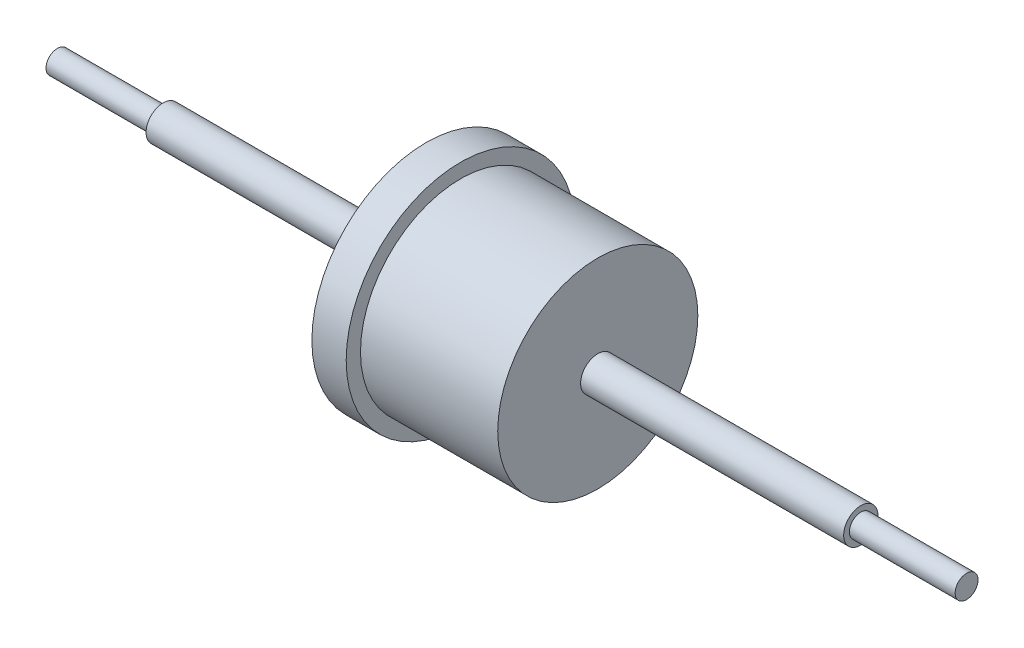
ISO-10303-21;
HEADER;
FILE_DESCRIPTION(('STEP AP214'),'2;1');
FILE_NAME('part.step','',(''),(''),'','','');
FILE_SCHEMA(('AUTOMOTIVE_DESIGN { 1 0 10303 214 1 1 1 1 }'));
ENDSEC;
DATA;
#1=APPLICATION_CONTEXT('core data for automotive mechanical design processes');
#2=APPLICATION_PROTOCOL_DEFINITION('international standard','automotive_design',2000,#1);
#3=PRODUCT_CONTEXT('',#1,'mechanical');
#4=PRODUCT('Part','Part','',(#3));
#5=PRODUCT_RELATED_PRODUCT_CATEGORY('part','',(#4));
#6=PRODUCT_DEFINITION_FORMATION('','',#4);
#7=PRODUCT_DEFINITION_CONTEXT('part definition',#1,'design');
#8=PRODUCT_DEFINITION('design','',#6,#7);
#9=PRODUCT_DEFINITION_SHAPE('','',#8);
#10=(LENGTH_UNIT() NAMED_UNIT(*) SI_UNIT(.MILLI.,.METRE.));
#11=(NAMED_UNIT(*) PLANE_ANGLE_UNIT() SI_UNIT($,.RADIAN.));
#12=(NAMED_UNIT(*) SI_UNIT($,.STERADIAN.) SOLID_ANGLE_UNIT());
#13=UNCERTAINTY_MEASURE_WITH_UNIT(LENGTH_MEASURE(1.E-05),#10,'distance_accuracy_value','');
#14=(GEOMETRIC_REPRESENTATION_CONTEXT(3) GLOBAL_UNCERTAINTY_ASSIGNED_CONTEXT((#13)) GLOBAL_UNIT_ASSIGNED_CONTEXT((#10,
#11,#12)) REPRESENTATION_CONTEXT('',''));
#15=CARTESIAN_POINT('',(0.,0.,0.));
#16=DIRECTION('',(0.,0.,1.));
#17=DIRECTION('',(1.,0.,0.));
#18=AXIS2_PLACEMENT_3D('',#15,#16,#17);
#19=CARTESIAN_POINT('',(90.,0.,-300.));
#20=DIRECTION('',(-1.,0.,0.));
#21=DIRECTION('',(0.,0.,1.));
#22=AXIS2_PLACEMENT_3D('',#19,#20,#21);
#23=CYLINDRICAL_SURFACE('',#22,2.);
#24=CARTESIAN_POINT('',(-61.,0.,-300.));
#25=DIRECTION('',(1.,0.,0.));
#26=DIRECTION('',(0.,0.,-1.));
#27=AXIS2_PLACEMENT_3D('',#24,#25,#26);
#28=CIRCLE('',#27,2.);
#29=CARTESIAN_POINT('',(-61.,0.,-298.));
#30=VERTEX_POINT('',#29);
#31=EDGE_CURVE('E36',#30,#30,#28,.T.);
#32=CARTESIAN_POINT('',(-79.5,0.,-300.));
#33=DIRECTION('',(1.,0.,0.));
#34=DIRECTION('',(0.,0.,-1.));
#35=AXIS2_PLACEMENT_3D('',#32,#33,#34);
#36=CIRCLE('',#35,2.);
#37=CARTESIAN_POINT('',(-79.5,0.,-298.));
#38=VERTEX_POINT('',#37);
#39=EDGE_CURVE('E70',#38,#38,#36,.T.);
#40=CARTESIAN_POINT('',(-61.,0.,-298.));
#41=CARTESIAN_POINT('',(-61.1927083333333,0.,-298.));
#42=CARTESIAN_POINT('',(-61.3854166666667,0.,-298.));
#43=CARTESIAN_POINT('',(-61.7708333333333,0.,-298.));
#44=CARTESIAN_POINT('',(-61.9635416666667,0.,-298.));
#45=CARTESIAN_POINT('',(-62.3489583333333,0.,-298.));
#46=CARTESIAN_POINT('',(-62.5416666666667,0.,-298.));
#47=CARTESIAN_POINT('',(-62.9270833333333,0.,-298.));
#48=CARTESIAN_POINT('',(-63.1197916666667,0.,-298.));
#49=CARTESIAN_POINT('',(-63.5052083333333,0.,-298.));
#50=CARTESIAN_POINT('',(-63.6979166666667,0.,-298.));
#51=CARTESIAN_POINT('',(-64.0833333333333,0.,-298.));
#52=CARTESIAN_POINT('',(-64.2760416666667,0.,-298.));
#53=CARTESIAN_POINT('',(-64.6614583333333,0.,-298.));
#54=CARTESIAN_POINT('',(-64.8541666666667,0.,-298.));
#55=CARTESIAN_POINT('',(-65.2395833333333,0.,-298.));
#56=CARTESIAN_POINT('',(-65.4322916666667,0.,-298.));
#57=CARTESIAN_POINT('',(-65.8177083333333,0.,-298.));
#58=CARTESIAN_POINT('',(-66.0104166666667,0.,-298.));
#59=CARTESIAN_POINT('',(-66.3958333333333,0.,-298.));
#60=CARTESIAN_POINT('',(-66.5885416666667,0.,-298.));
#61=CARTESIAN_POINT('',(-66.9739583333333,0.,-298.));
#62=CARTESIAN_POINT('',(-67.1666666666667,0.,-298.));
#63=CARTESIAN_POINT('',(-67.5520833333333,0.,-298.));
#64=CARTESIAN_POINT('',(-67.7447916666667,0.,-298.));
#65=CARTESIAN_POINT('',(-68.1302083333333,0.,-298.));
#66=CARTESIAN_POINT('',(-68.3229166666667,0.,-298.));
#67=CARTESIAN_POINT('',(-68.7083333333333,0.,-298.));
#68=CARTESIAN_POINT('',(-68.9010416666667,0.,-298.));
#69=CARTESIAN_POINT('',(-69.2864583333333,0.,-298.));
#70=CARTESIAN_POINT('',(-69.4791666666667,0.,-298.));
#71=CARTESIAN_POINT('',(-69.8645833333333,0.,-298.));
#72=CARTESIAN_POINT('',(-70.0572916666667,0.,-298.));
#73=CARTESIAN_POINT('',(-70.4427083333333,0.,-298.));
#74=CARTESIAN_POINT('',(-70.6354166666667,0.,-298.));
#75=CARTESIAN_POINT('',(-71.0208333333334,0.,-298.));
#76=CARTESIAN_POINT('',(-71.2135416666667,0.,-298.));
#77=CARTESIAN_POINT('',(-71.5989583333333,0.,-298.));
#78=CARTESIAN_POINT('',(-71.7916666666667,0.,-298.));
#79=CARTESIAN_POINT('',(-72.1770833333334,0.,-298.));
#80=CARTESIAN_POINT('',(-72.3697916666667,0.,-298.));
#81=CARTESIAN_POINT('',(-72.7552083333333,0.,-298.));
#82=CARTESIAN_POINT('',(-72.9479166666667,0.,-298.));
#83=CARTESIAN_POINT('',(-73.3333333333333,0.,-298.));
#84=CARTESIAN_POINT('',(-73.5260416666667,0.,-298.));
#85=CARTESIAN_POINT('',(-73.9114583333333,0.,-298.));
#86=CARTESIAN_POINT('',(-74.1041666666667,0.,-298.));
#87=CARTESIAN_POINT('',(-74.4895833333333,0.,-298.));
#88=CARTESIAN_POINT('',(-74.6822916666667,0.,-298.));
#89=CARTESIAN_POINT('',(-75.0677083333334,0.,-298.));
#90=CARTESIAN_POINT('',(-75.2604166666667,0.,-298.));
#91=CARTESIAN_POINT('',(-75.6458333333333,0.,-298.));
#92=CARTESIAN_POINT('',(-75.8385416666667,0.,-298.));
#93=CARTESIAN_POINT('',(-76.2239583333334,0.,-298.));
#94=CARTESIAN_POINT('',(-76.4166666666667,0.,-298.));
#95=CARTESIAN_POINT('',(-76.8020833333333,0.,-298.));
#96=CARTESIAN_POINT('',(-76.9947916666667,0.,-298.));
#97=CARTESIAN_POINT('',(-77.3802083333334,0.,-298.));
#98=CARTESIAN_POINT('',(-77.5729166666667,0.,-298.));
#99=CARTESIAN_POINT('',(-77.9583333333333,0.,-298.));
#100=CARTESIAN_POINT('',(-78.1510416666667,0.,-298.));
#101=CARTESIAN_POINT('',(-78.5364583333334,0.,-298.));
#102=CARTESIAN_POINT('',(-78.7291666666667,0.,-298.));
#103=CARTESIAN_POINT('',(-79.1145833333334,0.,-298.));
#104=CARTESIAN_POINT('',(-79.3072916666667,0.,-298.));
#105=CARTESIAN_POINT('',(-79.5,0.,-298.));
#106=B_SPLINE_CURVE_WITH_KNOTS('',3,(#40,#41,#42,#43,#44,#45,#46,#47,#48,#49,#50,#51,#52,#53,
#54,#55,#56,#57,#58,#59,#60,#61,#62,#63,#64,#65,#66,#67,#68,#69,#70,#71,#72,#73,#74,#75,#76,#77,
#78,#79,#80,#81,#82,#83,#84,#85,#86,#87,#88,#89,#90,#91,#92,#93,#94,#95,#96,#97,#98,#99,#100,
#101,#102,#103,#104,#105),.UNSPECIFIED.,.F.,.F.,(4,2,2,2,2,2,2,2,2,2,2,2,2,2,2,2,2,2,2,2,2,2,2,
2,2,2,2,2,2,2,2,2,4),(0.,0.578125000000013,1.15625,1.73437500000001,2.3125,2.89062500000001,
3.46874999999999,4.04687500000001,4.62499999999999,5.203125,5.78125000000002,6.359375,
6.93750000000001,7.515625,8.09375000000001,8.671875,9.25000000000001,9.82812500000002,10.40625,
10.984375,11.5625,12.140625,12.71875,13.296875,13.875,14.453125,15.03125,15.609375,16.1875,
16.765625,17.34375,17.921875,18.5),.UNSPECIFIED.);
#107=EDGE_CURVE('BSEAM29',#30,#38,#106,.T.);
#108=ORIENTED_EDGE('',*,*,#31,.F.);
#109=ORIENTED_EDGE('',*,*,#39,.T.);
#110=ORIENTED_EDGE('',*,*,#107,.T.);
#111=ORIENTED_EDGE('',*,*,#107,.F.);
#112=EDGE_LOOP('',(#108,#110,#109,#111));
#113=FACE_BOUND('',#112,.T.);
#114=ADVANCED_FACE('F29',(#113),#23,.T.);
#115=CARTESIAN_POINT('',(61.,0.,-300.));
#116=DIRECTION('',(-1.,0.,0.));
#117=DIRECTION('',(0.,0.,1.));
#118=AXIS2_PLACEMENT_3D('',#115,#116,#117);
#119=CIRCLE('',#118,2.);
#120=CARTESIAN_POINT('',(61.,0.,-298.));
#121=VERTEX_POINT('',#120);
#122=EDGE_CURVE('E40',#121,#121,#119,.T.);
#123=CARTESIAN_POINT('',(79.5,0.,-300.));
#124=DIRECTION('',(1.,0.,0.));
#125=DIRECTION('',(0.,0.,-1.));
#126=AXIS2_PLACEMENT_3D('',#123,#124,#125);
#127=CIRCLE('',#126,2.);
#128=CARTESIAN_POINT('',(79.5,0.,-298.));
#129=VERTEX_POINT('',#128);
#130=EDGE_CURVE('E67',#129,#129,#127,.T.);
#131=CARTESIAN_POINT('',(61.,0.,-298.));
#132=CARTESIAN_POINT('',(61.1927083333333,0.,-298.));
#133=CARTESIAN_POINT('',(61.3854166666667,0.,-298.));
#134=CARTESIAN_POINT('',(61.7708333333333,0.,-298.));
#135=CARTESIAN_POINT('',(61.9635416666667,0.,-298.));
#136=CARTESIAN_POINT('',(62.3489583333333,0.,-298.));
#137=CARTESIAN_POINT('',(62.5416666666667,0.,-298.));
#138=CARTESIAN_POINT('',(62.9270833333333,0.,-298.));
#139=CARTESIAN_POINT('',(63.1197916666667,0.,-298.));
#140=CARTESIAN_POINT('',(63.5052083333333,0.,-298.));
#141=CARTESIAN_POINT('',(63.6979166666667,0.,-298.));
#142=CARTESIAN_POINT('',(64.0833333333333,0.,-298.));
#143=CARTESIAN_POINT('',(64.2760416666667,0.,-298.));
#144=CARTESIAN_POINT('',(64.6614583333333,0.,-298.));
#145=CARTESIAN_POINT('',(64.8541666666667,0.,-298.));
#146=CARTESIAN_POINT('',(65.2395833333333,0.,-298.));
#147=CARTESIAN_POINT('',(65.4322916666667,0.,-298.));
#148=CARTESIAN_POINT('',(65.8177083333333,0.,-298.));
#149=CARTESIAN_POINT('',(66.0104166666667,0.,-298.));
#150=CARTESIAN_POINT('',(66.3958333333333,0.,-298.));
#151=CARTESIAN_POINT('',(66.5885416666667,0.,-298.));
#152=CARTESIAN_POINT('',(66.9739583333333,0.,-298.));
#153=CARTESIAN_POINT('',(67.1666666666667,0.,-298.));
#154=CARTESIAN_POINT('',(67.5520833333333,0.,-298.));
#155=CARTESIAN_POINT('',(67.7447916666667,0.,-298.));
#156=CARTESIAN_POINT('',(68.1302083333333,0.,-298.));
#157=CARTESIAN_POINT('',(68.3229166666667,0.,-298.));
#158=CARTESIAN_POINT('',(68.7083333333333,0.,-298.));
#159=CARTESIAN_POINT('',(68.9010416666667,0.,-298.));
#160=CARTESIAN_POINT('',(69.2864583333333,0.,-298.));
#161=CARTESIAN_POINT('',(69.4791666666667,0.,-298.));
#162=CARTESIAN_POINT('',(69.8645833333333,0.,-298.));
#163=CARTESIAN_POINT('',(70.0572916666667,0.,-298.));
#164=CARTESIAN_POINT('',(70.4427083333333,0.,-298.));
#165=CARTESIAN_POINT('',(70.6354166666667,0.,-298.));
#166=CARTESIAN_POINT('',(71.0208333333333,0.,-298.));
#167=CARTESIAN_POINT('',(71.2135416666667,0.,-298.));
#168=CARTESIAN_POINT('',(71.5989583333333,0.,-298.));
#169=CARTESIAN_POINT('',(71.7916666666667,0.,-298.));
#170=CARTESIAN_POINT('',(72.1770833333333,0.,-298.));
#171=CARTESIAN_POINT('',(72.3697916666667,0.,-298.));
#172=CARTESIAN_POINT('',(72.7552083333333,0.,-298.));
#173=CARTESIAN_POINT('',(72.9479166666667,0.,-298.));
#174=CARTESIAN_POINT('',(73.3333333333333,0.,-298.));
#175=CARTESIAN_POINT('',(73.5260416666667,0.,-298.));
#176=CARTESIAN_POINT('',(73.9114583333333,0.,-298.));
#177=CARTESIAN_POINT('',(74.1041666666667,0.,-298.));
#178=CARTESIAN_POINT('',(74.4895833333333,0.,-298.));
#179=CARTESIAN_POINT('',(74.6822916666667,0.,-298.));
#180=CARTESIAN_POINT('',(75.0677083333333,0.,-298.));
#181=CARTESIAN_POINT('',(75.2604166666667,0.,-298.));
#182=CARTESIAN_POINT('',(75.6458333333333,0.,-298.));
#183=CARTESIAN_POINT('',(75.8385416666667,0.,-298.));
#184=CARTESIAN_POINT('',(76.2239583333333,0.,-298.));
#185=CARTESIAN_POINT('',(76.4166666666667,0.,-298.));
#186=CARTESIAN_POINT('',(76.8020833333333,0.,-298.));
#187=CARTESIAN_POINT('',(76.9947916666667,0.,-298.));
#188=CARTESIAN_POINT('',(77.3802083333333,0.,-298.));
#189=CARTESIAN_POINT('',(77.5729166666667,0.,-298.));
#190=CARTESIAN_POINT('',(77.9583333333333,0.,-298.));
#191=CARTESIAN_POINT('',(78.1510416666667,0.,-298.));
#192=CARTESIAN_POINT('',(78.5364583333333,0.,-298.));
#193=CARTESIAN_POINT('',(78.7291666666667,0.,-298.));
#194=CARTESIAN_POINT('',(79.1145833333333,0.,-298.));
#195=CARTESIAN_POINT('',(79.3072916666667,0.,-298.));
#196=CARTESIAN_POINT('',(79.5,0.,-298.));
#197=B_SPLINE_CURVE_WITH_KNOTS('',3,(#131,#132,#133,#134,#135,#136,#137,#138,#139,#140,#141,
#142,#143,#144,#145,#146,#147,#148,#149,#150,#151,#152,#153,#154,#155,#156,#157,#158,#159,#160,
#161,#162,#163,#164,#165,#166,#167,#168,#169,#170,#171,#172,#173,#174,#175,#176,#177,#178,#179,
#180,#181,#182,#183,#184,#185,#186,#187,#188,#189,#190,#191,#192,#193,#194,#195,#196),
.UNSPECIFIED.,.F.,.F.,(4,2,2,2,2,2,2,2,2,2,2,2,2,2,2,2,2,2,2,2,2,2,2,2,2,2,2,2,2,2,2,2,4),(0.,
0.578124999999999,1.15625,1.73437500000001,2.3125,2.89062500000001,3.46875000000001,
4.04687500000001,4.625,5.203125,5.78125,6.359375,6.9375,7.515625,8.09375,8.671875,
9.25000000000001,9.82812500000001,10.40625,10.984375,11.5625,12.140625,12.71875,13.296875,
13.875,14.453125,15.03125,15.609375,16.1875,16.765625,17.34375,17.921875,18.5),.UNSPECIFIED.);
#198=EDGE_CURVE('BSEAM31',#121,#129,#197,.T.);
#199=ORIENTED_EDGE('',*,*,#122,.F.);
#200=ORIENTED_EDGE('',*,*,#130,.F.);
#201=ORIENTED_EDGE('',*,*,#198,.T.);
#202=ORIENTED_EDGE('',*,*,#198,.F.);
#203=EDGE_LOOP('',(#199,#201,#200,#202));
#204=FACE_BOUND('',#203,.T.);
#205=ADVANCED_FACE('F31',(#204),#23,.T.);
#206=CARTESIAN_POINT('',(-15.,0.,-300.));
#207=DIRECTION('',(1.,0.,0.));
#208=DIRECTION('',(0.,0.,-1.));
#209=AXIS2_PLACEMENT_3D('',#206,#207,#208);
#210=PLANE('',#209);
#211=CARTESIAN_POINT('',(-15.,0.,-300.));
#212=DIRECTION('',(1.,0.,0.));
#213=DIRECTION('',(0.,0.,-1.));
#214=AXIS2_PLACEMENT_3D('',#211,#212,#213);
#215=CIRCLE('',#214,20.);
#216=CARTESIAN_POINT('',(-15.,0.,-320.));
#217=VERTEX_POINT('',#216);
#218=EDGE_CURVE('E44',#217,#217,#215,.T.);
#219=ORIENTED_EDGE('',*,*,#218,.F.);
#220=EDGE_LOOP('',(#219));
#221=FACE_BOUND('',#220,.T.);
#222=CARTESIAN_POINT('',(-15.,0.,-300.));
#223=DIRECTION('',(1.,0.,0.));
#224=DIRECTION('',(0.,0.,-1.));
#225=AXIS2_PLACEMENT_3D('',#222,#223,#224);
#226=CIRCLE('',#225,2.99999999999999);
#227=CARTESIAN_POINT('',(-15.,0.,-303.));
#228=VERTEX_POINT('',#227);
#229=EDGE_CURVE('E10',#228,#228,#226,.F.);
#230=ORIENTED_EDGE('',*,*,#229,.F.);
#231=EDGE_LOOP('',(#230));
#232=FACE_BOUND('',#231,.T.);
#233=ADVANCED_FACE('F90',(#221,#232),#210,.F.);
#234=CARTESIAN_POINT('',(15.,0.,-300.));
#235=DIRECTION('',(1.,0.,0.));
#236=DIRECTION('',(0.,0.,-1.));
#237=AXIS2_PLACEMENT_3D('',#234,#235,#236);
#238=PLANE('',#237);
#239=CARTESIAN_POINT('',(15.,0.,-300.));
#240=DIRECTION('',(1.,0.,0.));
#241=DIRECTION('',(0.,0.,-1.));
#242=AXIS2_PLACEMENT_3D('',#239,#240,#241);
#243=CIRCLE('',#242,17.5);
#244=CARTESIAN_POINT('',(15.,0.,-317.5));
#245=VERTEX_POINT('',#244);
#246=EDGE_CURVE('E52',#245,#245,#243,.T.);
#247=ORIENTED_EDGE('',*,*,#246,.T.);
#248=EDGE_LOOP('',(#247));
#249=FACE_BOUND('',#248,.T.);
#250=CARTESIAN_POINT('',(15.,0.,-300.));
#251=DIRECTION('',(1.,0.,0.));
#252=DIRECTION('',(0.,0.,-1.));
#253=AXIS2_PLACEMENT_3D('',#250,#251,#252);
#254=CIRCLE('',#253,2.99999999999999);
#255=CARTESIAN_POINT('',(15.,0.,-303.));
#256=VERTEX_POINT('',#255);
#257=EDGE_CURVE('E47',#256,#256,#254,.F.);
#258=ORIENTED_EDGE('',*,*,#257,.T.);
#259=EDGE_LOOP('',(#258));
#260=FACE_BOUND('',#259,.T.);
#261=ADVANCED_FACE('F95',(#249,#260),#238,.T.);
#262=CARTESIAN_POINT('',(15.,0.,-300.));
#263=DIRECTION('',(-1.,0.,0.));
#264=DIRECTION('',(0.,0.,1.));
#265=AXIS2_PLACEMENT_3D('',#262,#263,#264);
#266=CYLINDRICAL_SURFACE('',#265,20.);
#267=CARTESIAN_POINT('',(-9.,0.,-300.));
#268=DIRECTION('',(-1.,0.,0.));
#269=DIRECTION('',(0.,0.,1.));
#270=AXIS2_PLACEMENT_3D('',#267,#268,#269);
#271=CIRCLE('',#270,20.);
#272=CARTESIAN_POINT('',(-9.,0.,-280.));
#273=VERTEX_POINT('',#272);
#274=EDGE_CURVE('E55',#273,#273,#271,.T.);
#275=ORIENTED_EDGE('',*,*,#274,.T.);
#276=EDGE_LOOP('',(#275));
#277=FACE_BOUND('',#276,.T.);
#278=ORIENTED_EDGE('',*,*,#218,.T.);
#279=EDGE_LOOP('',(#278));
#280=FACE_BOUND('',#279,.T.);
#281=ADVANCED_FACE('F124',(#277,#280),#266,.T.);
#282=CARTESIAN_POINT('',(-9.,0.,-288.));
#283=DIRECTION('',(-1.,0.,0.));
#284=DIRECTION('',(0.,0.,1.));
#285=AXIS2_PLACEMENT_3D('',#282,#283,#284);
#286=PLANE('',#285);
#287=CARTESIAN_POINT('',(-9.,0.,-300.));
#288=DIRECTION('',(-1.,0.,0.));
#289=DIRECTION('',(0.,0.,1.));
#290=AXIS2_PLACEMENT_3D('',#287,#288,#289);
#291=CIRCLE('',#290,17.5);
#292=CARTESIAN_POINT('',(-9.,0.,-282.5));
#293=VERTEX_POINT('',#292);
#294=EDGE_CURVE('E50',#293,#293,#291,.T.);
#295=ORIENTED_EDGE('',*,*,#294,.T.);
#296=EDGE_LOOP('',(#295));
#297=FACE_BOUND('',#296,.T.);
#298=ORIENTED_EDGE('',*,*,#274,.F.);
#299=EDGE_LOOP('',(#298));
#300=FACE_BOUND('',#299,.T.);
#301=ADVANCED_FACE('F115',(#297,#300),#286,.F.);
#302=CARTESIAN_POINT('',(90.,0.,-300.));
#303=DIRECTION('',(-1.,0.,0.));
#304=DIRECTION('',(0.,0.,1.));
#305=AXIS2_PLACEMENT_3D('',#302,#303,#304);
#306=CYLINDRICAL_SURFACE('',#305,17.5);
#307=ORIENTED_EDGE('',*,*,#246,.F.);
#308=EDGE_LOOP('',(#307));
#309=FACE_BOUND('',#308,.T.);
#310=ORIENTED_EDGE('',*,*,#294,.F.);
#311=EDGE_LOOP('',(#310));
#312=FACE_BOUND('',#311,.T.);
#313=ADVANCED_FACE('F105',(#309,#312),#306,.T.);
#314=CARTESIAN_POINT('',(61.,0.,-300.));
#315=DIRECTION('',(-1.,0.,0.));
#316=DIRECTION('',(0.,0.,1.));
#317=AXIS2_PLACEMENT_3D('',#314,#315,#316);
#318=PLANE('',#317);
#319=CARTESIAN_POINT('',(61.,0.,-300.));
#320=DIRECTION('',(-1.,0.,0.));
#321=DIRECTION('',(0.,0.,1.));
#322=AXIS2_PLACEMENT_3D('',#319,#320,#321);
#323=CIRCLE('',#322,2.99999999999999);
#324=CARTESIAN_POINT('',(61.,0.,-297.));
#325=VERTEX_POINT('',#324);
#326=EDGE_CURVE('E51',#325,#325,#323,.T.);
#327=ORIENTED_EDGE('',*,*,#326,.F.);
#328=EDGE_LOOP('',(#327));
#329=FACE_BOUND('',#328,.T.);
#330=ORIENTED_EDGE('',*,*,#122,.T.);
#331=EDGE_LOOP('',(#330));
#332=FACE_BOUND('',#331,.T.);
#333=ADVANCED_FACE('F102',(#329,#332),#318,.F.);
#334=CARTESIAN_POINT('',(69.4852813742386,0.,-300.));
#335=DIRECTION('',(-1.,0.,0.));
#336=DIRECTION('',(0.,0.,1.));
#337=AXIS2_PLACEMENT_3D('',#334,#335,#336);
#338=CYLINDRICAL_SURFACE('',#337,2.99999999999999);
#339=ORIENTED_EDGE('',*,*,#257,.F.);
#340=EDGE_LOOP('',(#339));
#341=FACE_BOUND('',#340,.T.);
#342=ORIENTED_EDGE('',*,*,#326,.T.);
#343=EDGE_LOOP('',(#342));
#344=FACE_BOUND('',#343,.T.);
#345=ADVANCED_FACE('F104',(#341,#344),#338,.T.);
#346=CARTESIAN_POINT('',(-61.,0.,-300.));
#347=DIRECTION('',(1.,0.,0.));
#348=DIRECTION('',(0.,0.,1.));
#349=AXIS2_PLACEMENT_3D('',#346,#347,#348);
#350=PLANE('',#349);
#351=CARTESIAN_POINT('',(-61.,0.,-300.));
#352=DIRECTION('',(-1.,0.,0.));
#353=DIRECTION('',(0.,0.,1.));
#354=AXIS2_PLACEMENT_3D('',#351,#352,#353);
#355=CIRCLE('',#354,2.99999999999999);
#356=CARTESIAN_POINT('',(-61.,0.,-297.));
#357=VERTEX_POINT('',#356);
#358=EDGE_CURVE('E64',#357,#357,#355,.T.);
#359=ORIENTED_EDGE('',*,*,#358,.T.);
#360=EDGE_LOOP('',(#359));
#361=FACE_BOUND('',#360,.T.);
#362=ORIENTED_EDGE('',*,*,#31,.T.);
#363=EDGE_LOOP('',(#362));
#364=FACE_BOUND('',#363,.T.);
#365=ADVANCED_FACE('F112',(#361,#364),#350,.F.);
#366=CARTESIAN_POINT('',(-69.4852813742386,0.,-300.));
#367=DIRECTION('',(1.,0.,0.));
#368=DIRECTION('',(0.,0.,1.));
#369=AXIS2_PLACEMENT_3D('',#366,#367,#368);
#370=CYLINDRICAL_SURFACE('',#369,2.99999999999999);
#371=ORIENTED_EDGE('',*,*,#229,.T.);
#372=EDGE_LOOP('',(#371));
#373=FACE_BOUND('',#372,.T.);
#374=ORIENTED_EDGE('',*,*,#358,.F.);
#375=EDGE_LOOP('',(#374));
#376=FACE_BOUND('',#375,.T.);
#377=ADVANCED_FACE('F82',(#373,#376),#370,.T.);
#378=CARTESIAN_POINT('',(79.5,0.,-300.));
#379=DIRECTION('',(1.,0.,0.));
#380=DIRECTION('',(0.,0.,-1.));
#381=AXIS2_PLACEMENT_3D('',#378,#379,#380);
#382=PLANE('',#381);
#383=ORIENTED_EDGE('',*,*,#130,.T.);
#384=EDGE_LOOP('',(#383));
#385=FACE_BOUND('',#384,.T.);
#386=ADVANCED_FACE('F77',(#385),#382,.T.);
#387=CARTESIAN_POINT('',(-79.5,0.,-300.));
#388=DIRECTION('',(-1.,0.,0.));
#389=DIRECTION('',(0.,0.,-1.));
#390=AXIS2_PLACEMENT_3D('',#387,#388,#389);
#391=PLANE('',#390);
#392=ORIENTED_EDGE('',*,*,#39,.F.);
#393=EDGE_LOOP('',(#392));
#394=FACE_BOUND('',#393,.T.);
#395=ADVANCED_FACE('F75',(#394),#391,.T.);
#396=CLOSED_SHELL('',(#114,#205,#233,#261,#281,#301,#313,#333,#345,#365,#377,#386,#395));
#397=MANIFOLD_SOLID_BREP('B2',#396);
#398=ADVANCED_BREP_SHAPE_REPRESENTATION('',(#18,#397),#14);
#399=SHAPE_DEFINITION_REPRESENTATION(#9,#398);
ENDSEC;
END-ISO-10303-21;
